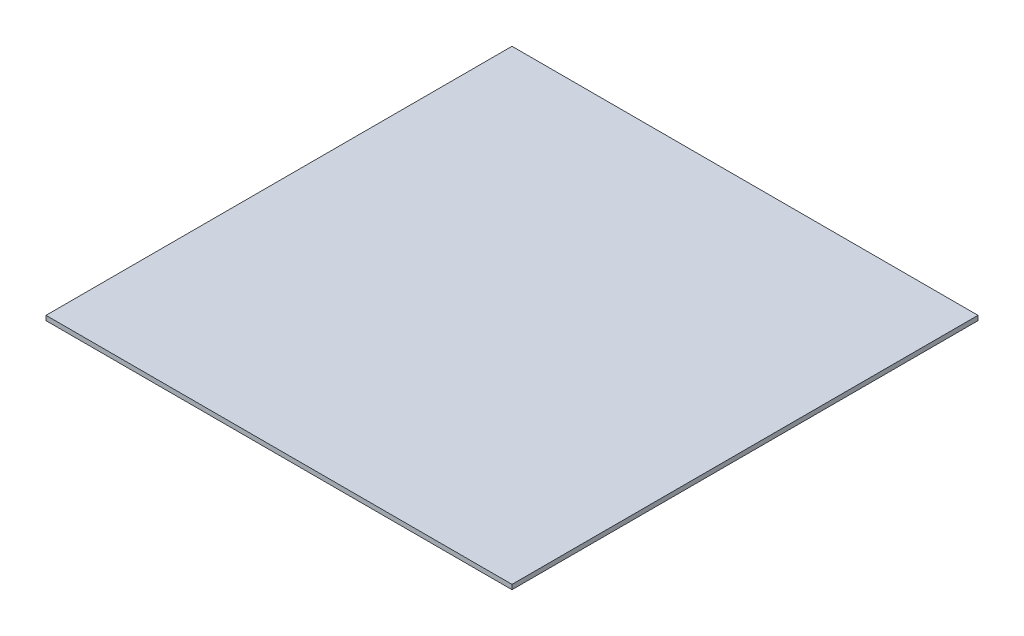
from build123d import *

# Parameters (mm, degrees)
ESQUISSE1_W      = 20
ESQUISSE1_H      = 20
EXTRUSION1_DEPTH = 0.2


with BuildPart() as part:
    # Esquisse1 → Extrusion1 (new body)
    with BuildSketch(Plane(origin=(0, 0, 0), x_dir=(1, 0, 0), z_dir=(0, 1, 0))):
        with Locations((10, 10)):
            Rectangle(ESQUISSE1_W, ESQUISSE1_H)
    extrude(amount=EXTRUSION1_DEPTH)


solid = part.part
